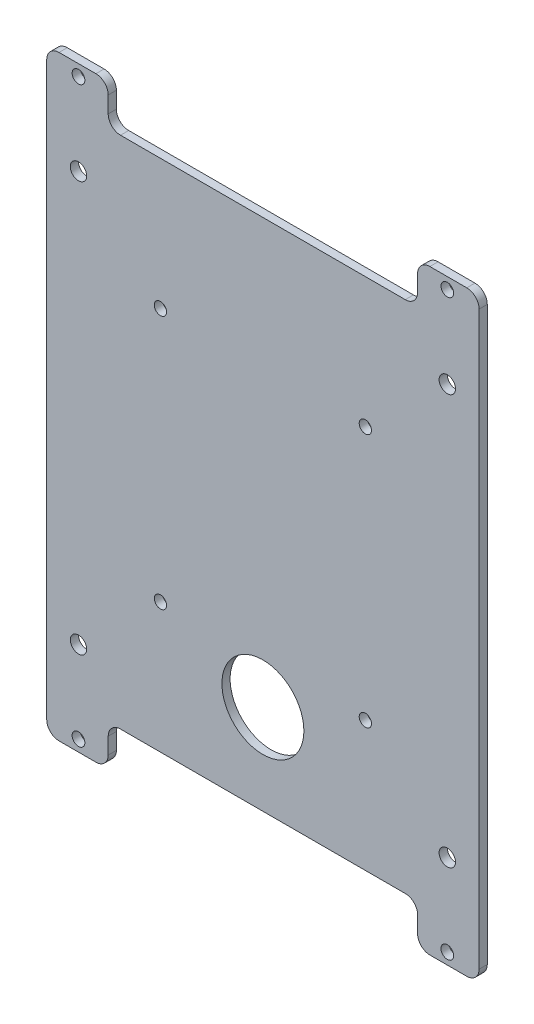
from build123d import *

# Parameters (mm, degrees)
SKETCH_1_W          = 105.5
SKETCH_1_H          = 121.5
SKETCH_1_R          = 2
SKETCH_1_R_2        = 1.5
SKETCH_1_R_3        = 10
EXTRUDE_1_DEPTH     = 2
SKETCH_2_W          = 105.5
SKETCH_2_H          = 12
SKETCH_2_R          = 1.55
EXTRUDE_2_DEPTH     = 2
SKETCH_3_W          = 75.5
SKETCH_3_H          = 10
CUT_EXTRUDE_1_DEPTH = 10
FILLET_1_R          = 3


with BuildPart() as part:
    # Sketch 1 → Extrude 1 (new body)
    with BuildSketch(Plane.XY):
        Rectangle(SKETCH_1_W, SKETCH_1_H)
        with Locations((-45, 50)):
            Circle(SKETCH_1_R, mode=Mode.SUBTRACT)
        with Locations((-25, 31)):
            Circle(SKETCH_1_R_2, mode=Mode.SUBTRACT)
        with Locations((45, 50)):
            Circle(SKETCH_1_R, mode=Mode.SUBTRACT)
        with Locations((45, -50)):
            Circle(SKETCH_1_R, mode=Mode.SUBTRACT)
        with Locations((-45, -50)):
            Circle(SKETCH_1_R, mode=Mode.SUBTRACT)
        with Locations((25, 31)):
            Circle(SKETCH_1_R_2, mode=Mode.SUBTRACT)
        with Locations((25, -31)):
            Circle(SKETCH_1_R_2, mode=Mode.SUBTRACT)
        with Locations((-25, -31)):
            Circle(SKETCH_1_R_2, mode=Mode.SUBTRACT)
        with Locations((0, -40.75)):
            Circle(SKETCH_1_R_3, mode=Mode.SUBTRACT)
    extrude(amount=EXTRUDE_1_DEPTH)

    # Sketch 2 → Extrude 2 (add)
    # profile 1 of 2: a face of its own
    with BuildSketch(Plane.XY.offset(2)):
        with Locations((0, -66.75)):
            Rectangle(SKETCH_2_W, SKETCH_2_H)
        with Locations((-45, -70)):
            Circle(SKETCH_2_R, mode=Mode.SUBTRACT)
        with Locations((45, -70)):
            Circle(SKETCH_2_R, mode=Mode.SUBTRACT)
    # profile 2 of 2: a face of its own
    with BuildSketch(Plane.XY.offset(2)):
        with Locations((0, 66.75)):
            Rectangle(SKETCH_2_W, SKETCH_2_H)
        with Locations(Location((45, 70, 0), (0, 0, 180))):
            Circle(SKETCH_2_R, mode=Mode.SUBTRACT)
        with Locations(Location((-45, 70, 0), (0, 0, 180))):
            Circle(SKETCH_2_R, mode=Mode.SUBTRACT)
    extrude(amount=-EXTRUDE_2_DEPTH)

    # Sketch 3 → Cut-Extrude 1 (cut)
    with BuildSketch(Plane.XY.offset(2)):
        with Locations((0, 67.75)):
            Rectangle(SKETCH_3_W, SKETCH_3_H)
        with Locations((0, -67.75)):
            Rectangle(SKETCH_3_W, SKETCH_3_H)
    extrude(amount=-CUT_EXTRUDE_1_DEPTH, mode=Mode.SUBTRACT)

    # Fillet 1
    fillet_1_edges = [part.edges().sort_by_distance(p)[0] for p in [
        (37.75, -72.75, 1),
        (-37.75, -72.75, 1),
        (-37.75, -62.75, 1),
        (37.75, -62.75, 1),
        (-52.75, -72.75, 1),
        (52.75, -72.75, 1),
        (-52.75, 72.75, 1),
        (52.75, 72.75, 1),
        (37.75, 72.75, 1),
        (-37.75, 72.75, 1),
        (-37.75, 62.75, 1),
        (37.75, 62.75, 1),
    ]]
    fillet(fillet_1_edges, radius=FILLET_1_R)


solid = part.part
